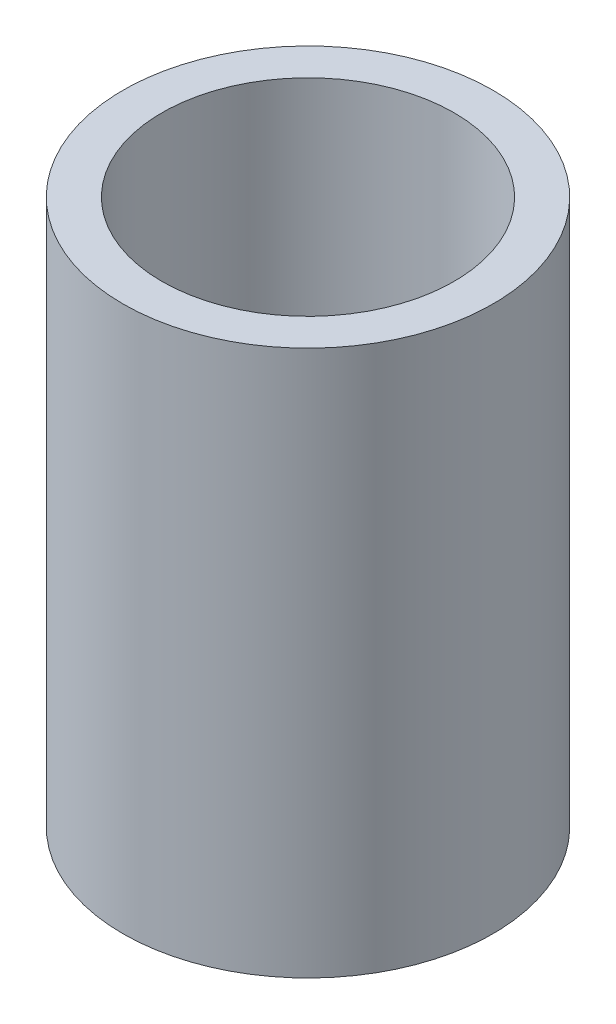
ISO-10303-21;
HEADER;
FILE_DESCRIPTION(('STEP AP214'),'2;1');
FILE_NAME('part.step','',(''),(''),'','','');
FILE_SCHEMA(('AUTOMOTIVE_DESIGN { 1 0 10303 214 1 1 1 1 }'));
ENDSEC;
DATA;
#1=APPLICATION_CONTEXT('core data for automotive mechanical design processes');
#2=APPLICATION_PROTOCOL_DEFINITION('international standard','automotive_design',2000,#1);
#3=PRODUCT_CONTEXT('',#1,'mechanical');
#4=PRODUCT('Part','Part','',(#3));
#5=PRODUCT_RELATED_PRODUCT_CATEGORY('part','',(#4));
#6=PRODUCT_DEFINITION_FORMATION('','',#4);
#7=PRODUCT_DEFINITION_CONTEXT('part definition',#1,'design');
#8=PRODUCT_DEFINITION('design','',#6,#7);
#9=PRODUCT_DEFINITION_SHAPE('','',#8);
#10=(LENGTH_UNIT() NAMED_UNIT(*) SI_UNIT(.MILLI.,.METRE.));
#11=(NAMED_UNIT(*) PLANE_ANGLE_UNIT() SI_UNIT($,.RADIAN.));
#12=(NAMED_UNIT(*) SI_UNIT($,.STERADIAN.) SOLID_ANGLE_UNIT());
#13=UNCERTAINTY_MEASURE_WITH_UNIT(LENGTH_MEASURE(1.E-05),#10,'distance_accuracy_value','');
#14=(GEOMETRIC_REPRESENTATION_CONTEXT(3) GLOBAL_UNCERTAINTY_ASSIGNED_CONTEXT((#13)) GLOBAL_UNIT_ASSIGNED_CONTEXT((#10,
#11,#12)) REPRESENTATION_CONTEXT('',''));
#15=CARTESIAN_POINT('',(0.,0.,0.));
#16=DIRECTION('',(0.,0.,1.));
#17=DIRECTION('',(1.,0.,0.));
#18=AXIS2_PLACEMENT_3D('',#15,#16,#17);
#19=CARTESIAN_POINT('',(0.,88.9,0.));
#20=DIRECTION('',(0.,-1.,0.));
#21=DIRECTION('',(0.,0.,-1.));
#22=AXIS2_PLACEMENT_3D('',#19,#20,#21);
#23=CYLINDRICAL_SURFACE('',#22,30.1625);
#24=CARTESIAN_POINT('',(0.,88.9,0.));
#25=DIRECTION('',(0.,1.,0.));
#26=DIRECTION('',(0.,0.,1.));
#27=AXIS2_PLACEMENT_3D('',#24,#25,#26);
#28=CIRCLE('',#27,30.1625);
#29=CARTESIAN_POINT('',(0.,88.9,30.1625));
#30=VERTEX_POINT('',#29);
#31=EDGE_CURVE('E10',#30,#30,#28,.T.);
#32=ORIENTED_EDGE('',*,*,#31,.F.);
#33=EDGE_LOOP('',(#32));
#34=FACE_BOUND('',#33,.T.);
#35=CARTESIAN_POINT('',(0.,0.,0.));
#36=DIRECTION('',(0.,1.,0.));
#37=DIRECTION('',(0.,0.,1.));
#38=AXIS2_PLACEMENT_3D('',#35,#36,#37);
#39=CIRCLE('',#38,30.1625);
#40=CARTESIAN_POINT('',(0.,0.,30.1625));
#41=VERTEX_POINT('',#40);
#42=EDGE_CURVE('E31',#41,#41,#39,.T.);
#43=ORIENTED_EDGE('',*,*,#42,.T.);
#44=EDGE_LOOP('',(#43));
#45=FACE_BOUND('',#44,.T.);
#46=ADVANCED_FACE('F28',(#34,#45),#23,.T.);
#47=CARTESIAN_POINT('',(0.,88.9,0.));
#48=DIRECTION('',(0.,1.,0.));
#49=DIRECTION('',(0.,0.,1.));
#50=AXIS2_PLACEMENT_3D('',#47,#48,#49);
#51=PLANE('',#50);
#52=CARTESIAN_POINT('',(0.,88.9,0.));
#53=DIRECTION('',(0.,-1.,0.));
#54=DIRECTION('',(0.,0.,-1.));
#55=AXIS2_PLACEMENT_3D('',#52,#53,#54);
#56=CIRCLE('',#55,23.8125);
#57=CARTESIAN_POINT('',(0.,88.9,-23.8125));
#58=VERTEX_POINT('',#57);
#59=EDGE_CURVE('E38',#58,#58,#56,.T.);
#60=ORIENTED_EDGE('',*,*,#59,.T.);
#61=EDGE_LOOP('',(#60));
#62=FACE_BOUND('',#61,.T.);
#63=ORIENTED_EDGE('',*,*,#31,.T.);
#64=EDGE_LOOP('',(#63));
#65=FACE_BOUND('',#64,.T.);
#66=ADVANCED_FACE('F46',(#62,#65),#51,.T.);
#67=CARTESIAN_POINT('',(0.,0.,0.));
#68=DIRECTION('',(0.,1.,0.));
#69=DIRECTION('',(0.,0.,1.));
#70=AXIS2_PLACEMENT_3D('',#67,#68,#69);
#71=PLANE('',#70);
#72=CARTESIAN_POINT('',(0.,0.,0.));
#73=DIRECTION('',(0.,-1.,0.));
#74=DIRECTION('',(0.,0.,-1.));
#75=AXIS2_PLACEMENT_3D('',#72,#73,#74);
#76=CIRCLE('',#75,23.8125);
#77=CARTESIAN_POINT('',(0.,0.,-23.8125));
#78=VERTEX_POINT('',#77);
#79=EDGE_CURVE('E40',#78,#78,#76,.T.);
#80=ORIENTED_EDGE('',*,*,#79,.F.);
#81=EDGE_LOOP('',(#80));
#82=FACE_BOUND('',#81,.T.);
#83=ORIENTED_EDGE('',*,*,#42,.F.);
#84=EDGE_LOOP('',(#83));
#85=FACE_BOUND('',#84,.T.);
#86=ADVANCED_FACE('F51',(#82,#85),#71,.F.);
#87=CARTESIAN_POINT('',(0.,88.9,0.));
#88=DIRECTION('',(0.,-1.,0.));
#89=DIRECTION('',(0.,0.,-1.));
#90=AXIS2_PLACEMENT_3D('',#87,#88,#89);
#91=CYLINDRICAL_SURFACE('',#90,23.8125);
#92=ORIENTED_EDGE('',*,*,#59,.F.);
#93=EDGE_LOOP('',(#92));
#94=FACE_BOUND('',#93,.T.);
#95=ORIENTED_EDGE('',*,*,#79,.T.);
#96=EDGE_LOOP('',(#95));
#97=FACE_BOUND('',#96,.T.);
#98=ADVANCED_FACE('F48',(#94,#97),#91,.F.);
#99=CLOSED_SHELL('',(#46,#66,#86,#98));
#100=MANIFOLD_SOLID_BREP('B2',#99);
#101=ADVANCED_BREP_SHAPE_REPRESENTATION('',(#18,#100),#14);
#102=SHAPE_DEFINITION_REPRESENTATION(#9,#101);
ENDSEC;
END-ISO-10303-21;
